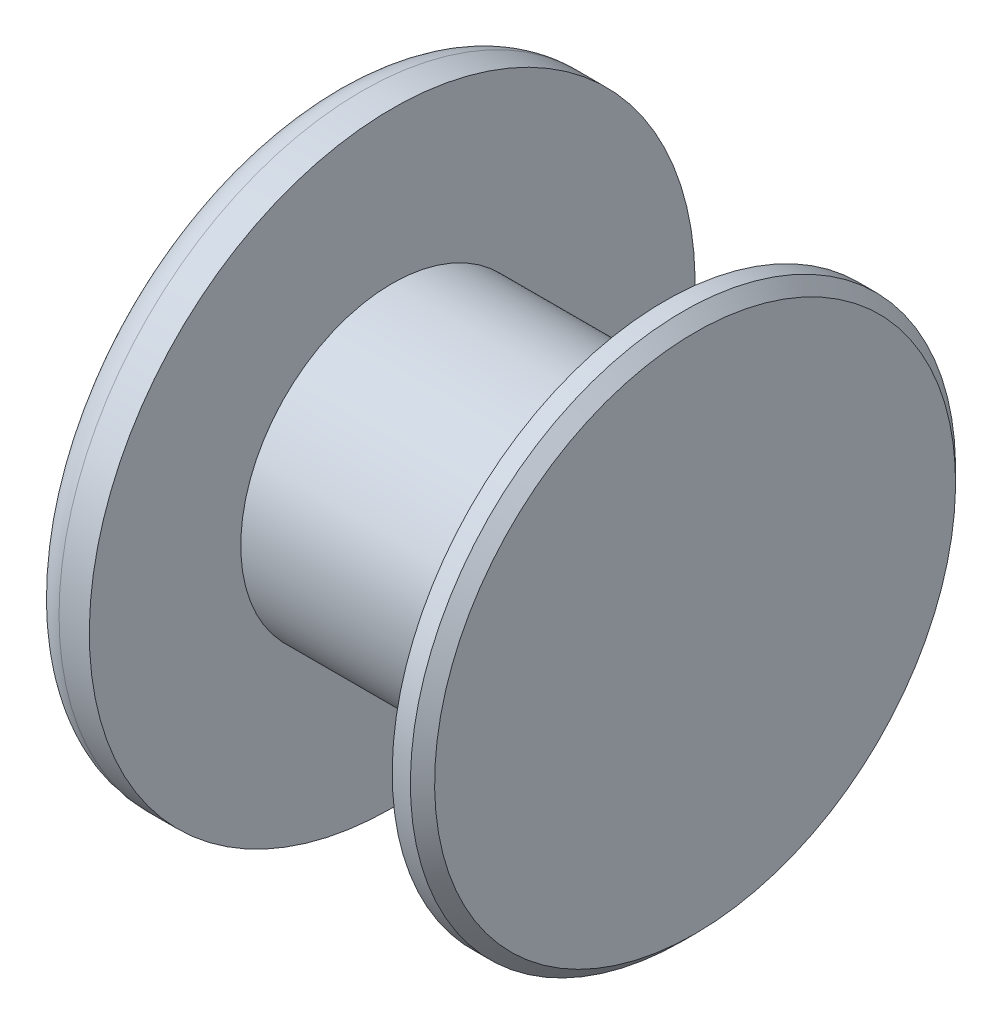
ISO-10303-21;
HEADER;
FILE_DESCRIPTION(('STEP AP214'),'2;1');
FILE_NAME('part.step','',(''),(''),'','','');
FILE_SCHEMA(('AUTOMOTIVE_DESIGN { 1 0 10303 214 1 1 1 1 }'));
ENDSEC;
DATA;
#1=APPLICATION_CONTEXT('core data for automotive mechanical design processes');
#2=APPLICATION_PROTOCOL_DEFINITION('international standard','automotive_design',2000,#1);
#3=PRODUCT_CONTEXT('',#1,'mechanical');
#4=PRODUCT('Part','Part','',(#3));
#5=PRODUCT_RELATED_PRODUCT_CATEGORY('part','',(#4));
#6=PRODUCT_DEFINITION_FORMATION('','',#4);
#7=PRODUCT_DEFINITION_CONTEXT('part definition',#1,'design');
#8=PRODUCT_DEFINITION('design','',#6,#7);
#9=PRODUCT_DEFINITION_SHAPE('','',#8);
#10=(LENGTH_UNIT() NAMED_UNIT(*) SI_UNIT(.MILLI.,.METRE.));
#11=(NAMED_UNIT(*) PLANE_ANGLE_UNIT() SI_UNIT($,.RADIAN.));
#12=(NAMED_UNIT(*) SI_UNIT($,.STERADIAN.) SOLID_ANGLE_UNIT());
#13=UNCERTAINTY_MEASURE_WITH_UNIT(LENGTH_MEASURE(1.E-05),#10,'distance_accuracy_value','');
#14=(GEOMETRIC_REPRESENTATION_CONTEXT(3) GLOBAL_UNCERTAINTY_ASSIGNED_CONTEXT((#13)) GLOBAL_UNIT_ASSIGNED_CONTEXT((#10,
#11,#12)) REPRESENTATION_CONTEXT('',''));
#15=CARTESIAN_POINT('',(0.,0.,0.));
#16=DIRECTION('',(0.,0.,1.));
#17=DIRECTION('',(1.,0.,0.));
#18=AXIS2_PLACEMENT_3D('',#15,#16,#17);
#19=CARTESIAN_POINT('',(3.,4.5,0.));
#20=DIRECTION('',(-1.,0.,0.));
#21=DIRECTION('',(0.,-1.,0.));
#22=AXIS2_PLACEMENT_3D('',#19,#20,#21);
#23=PLANE('',#22);
#24=CARTESIAN_POINT('',(3.,0.,0.));
#25=DIRECTION('',(-1.,0.,0.));
#26=DIRECTION('',(0.,-1.,0.));
#27=AXIS2_PLACEMENT_3D('',#24,#25,#26);
#28=CIRCLE('',#27,4.3);
#29=CARTESIAN_POINT('',(3.,-4.3,0.));
#30=VERTEX_POINT('',#29);
#31=EDGE_CURVE('E10',#30,#30,#28,.F.);
#32=ORIENTED_EDGE('',*,*,#31,.T.);
#33=EDGE_LOOP('',(#32));
#34=FACE_BOUND('',#33,.T.);
#35=ADVANCED_FACE('F41',(#34),#23,.F.);
#36=CARTESIAN_POINT('',(-3.,0.,0.));
#37=DIRECTION('',(1.,0.,0.));
#38=DIRECTION('',(0.,1.,0.));
#39=AXIS2_PLACEMENT_3D('',#36,#37,#38);
#40=PLANE('',#39);
#41=CARTESIAN_POINT('',(-3.,0.,0.));
#42=DIRECTION('',(1.,0.,0.));
#43=DIRECTION('',(0.,1.,0.));
#44=AXIS2_PLACEMENT_3D('',#41,#42,#43);
#45=CIRCLE('',#44,4.5);
#46=CARTESIAN_POINT('',(-3.,4.5,0.));
#47=VERTEX_POINT('',#46);
#48=EDGE_CURVE('E57',#47,#47,#45,.F.);
#49=ORIENTED_EDGE('',*,*,#48,.T.);
#50=EDGE_LOOP('',(#49));
#51=FACE_BOUND('',#50,.T.);
#52=ADVANCED_FACE('F90',(#51),#40,.F.);
#53=CARTESIAN_POINT('',(-3.,0.,0.));
#54=DIRECTION('',(-1.,0.,0.));
#55=DIRECTION('',(0.,-1.,0.));
#56=AXIS2_PLACEMENT_3D('',#53,#54,#55);
#57=CYLINDRICAL_SURFACE('',#56,5.);
#58=CARTESIAN_POINT('',(-2.5,0.,0.));
#59=DIRECTION('',(1.,0.,0.));
#60=DIRECTION('',(0.,1.,0.));
#61=AXIS2_PLACEMENT_3D('',#58,#59,#60);
#62=CIRCLE('',#61,5.);
#63=CARTESIAN_POINT('',(-2.5,5.,0.));
#64=VERTEX_POINT('',#63);
#65=EDGE_CURVE('E53',#64,#64,#62,.T.);
#66=ORIENTED_EDGE('',*,*,#65,.T.);
#67=EDGE_LOOP('',(#66));
#68=FACE_BOUND('',#67,.T.);
#69=CARTESIAN_POINT('',(-2.,0.,0.));
#70=DIRECTION('',(-1.,0.,0.));
#71=DIRECTION('',(0.,-1.,0.));
#72=AXIS2_PLACEMENT_3D('',#69,#70,#71);
#73=CIRCLE('',#72,5.);
#74=CARTESIAN_POINT('',(-2.,-5.,0.));
#75=VERTEX_POINT('',#74);
#76=EDGE_CURVE('E62',#75,#75,#73,.T.);
#77=ORIENTED_EDGE('',*,*,#76,.T.);
#78=EDGE_LOOP('',(#77));
#79=FACE_BOUND('',#78,.T.);
#80=ADVANCED_FACE('F95',(#68,#79),#57,.T.);
#81=CARTESIAN_POINT('',(-2.,5.,0.));
#82=DIRECTION('',(-1.,0.,0.));
#83=DIRECTION('',(0.,-1.,0.));
#84=AXIS2_PLACEMENT_3D('',#81,#82,#83);
#85=PLANE('',#84);
#86=ORIENTED_EDGE('',*,*,#76,.F.);
#87=EDGE_LOOP('',(#86));
#88=FACE_BOUND('',#87,.T.);
#89=CARTESIAN_POINT('',(-2.,0.,0.));
#90=DIRECTION('',(-1.,0.,0.));
#91=DIRECTION('',(0.,-1.,0.));
#92=AXIS2_PLACEMENT_3D('',#89,#90,#91);
#93=CIRCLE('',#92,2.5);
#94=CARTESIAN_POINT('',(-2.,-2.5,0.));
#95=VERTEX_POINT('',#94);
#96=EDGE_CURVE('E65',#95,#95,#93,.T.);
#97=ORIENTED_EDGE('',*,*,#96,.T.);
#98=EDGE_LOOP('',(#97));
#99=FACE_BOUND('',#98,.T.);
#100=ADVANCED_FACE('F101',(#88,#99),#85,.F.);
#101=CARTESIAN_POINT('',(-3.,0.,0.));
#102=DIRECTION('',(-1.,0.,0.));
#103=DIRECTION('',(0.,-1.,0.));
#104=AXIS2_PLACEMENT_3D('',#101,#102,#103);
#105=CYLINDRICAL_SURFACE('',#104,2.5);
#106=ORIENTED_EDGE('',*,*,#96,.F.);
#107=EDGE_LOOP('',(#106));
#108=FACE_BOUND('',#107,.T.);
#109=CARTESIAN_POINT('',(2.5,0.,0.));
#110=DIRECTION('',(-1.,0.,0.));
#111=DIRECTION('',(0.,-1.,0.));
#112=AXIS2_PLACEMENT_3D('',#109,#110,#111);
#113=CIRCLE('',#112,2.5);
#114=CARTESIAN_POINT('',(2.5,-2.5,0.));
#115=VERTEX_POINT('',#114);
#116=EDGE_CURVE('E68',#115,#115,#113,.T.);
#117=ORIENTED_EDGE('',*,*,#116,.T.);
#118=EDGE_LOOP('',(#117));
#119=FACE_BOUND('',#118,.T.);
#120=ADVANCED_FACE('F86',(#108,#119),#105,.T.);
#121=CARTESIAN_POINT('',(2.5,2.5,0.));
#122=DIRECTION('',(1.,0.,0.));
#123=DIRECTION('',(0.,1.,0.));
#124=AXIS2_PLACEMENT_3D('',#121,#122,#123);
#125=PLANE('',#124);
#126=ORIENTED_EDGE('',*,*,#116,.F.);
#127=EDGE_LOOP('',(#126));
#128=FACE_BOUND('',#127,.T.);
#129=CARTESIAN_POINT('',(2.5,0.,0.));
#130=DIRECTION('',(-1.,0.,0.));
#131=DIRECTION('',(0.,-1.,0.));
#132=AXIS2_PLACEMENT_3D('',#129,#130,#131);
#133=CIRCLE('',#132,4.5);
#134=CARTESIAN_POINT('',(2.5,-4.5,0.));
#135=VERTEX_POINT('',#134);
#136=EDGE_CURVE('E71',#135,#135,#133,.T.);
#137=ORIENTED_EDGE('',*,*,#136,.T.);
#138=EDGE_LOOP('',(#137));
#139=FACE_BOUND('',#138,.T.);
#140=ADVANCED_FACE('F75',(#128,#139),#125,.F.);
#141=CARTESIAN_POINT('',(-3.,0.,0.));
#142=DIRECTION('',(-1.,0.,0.));
#143=DIRECTION('',(0.,-1.,0.));
#144=AXIS2_PLACEMENT_3D('',#141,#142,#143);
#145=CYLINDRICAL_SURFACE('',#144,4.5);
#146=CARTESIAN_POINT('',(2.8,0.,0.));
#147=DIRECTION('',(-1.,0.,0.));
#148=DIRECTION('',(0.,-1.,0.));
#149=AXIS2_PLACEMENT_3D('',#146,#147,#148);
#150=CIRCLE('',#149,4.5);
#151=CARTESIAN_POINT('',(2.8,-4.5,0.));
#152=VERTEX_POINT('',#151);
#153=EDGE_CURVE('E49',#152,#152,#150,.T.);
#154=ORIENTED_EDGE('',*,*,#153,.T.);
#155=EDGE_LOOP('',(#154));
#156=FACE_BOUND('',#155,.T.);
#157=ORIENTED_EDGE('',*,*,#136,.F.);
#158=EDGE_LOOP('',(#157));
#159=FACE_BOUND('',#158,.T.);
#160=ADVANCED_FACE('F77',(#156,#159),#145,.T.);
#161=CARTESIAN_POINT('',(-2.5,0.,0.));
#162=DIRECTION('',(1.,0.,0.));
#163=DIRECTION('',(0.,1.,0.));
#164=AXIS2_PLACEMENT_3D('',#161,#162,#163);
#165=TOROIDAL_SURFACE('',#164,4.5,0.5);
#166=ORIENTED_EDGE('',*,*,#65,.F.);
#167=EDGE_LOOP('',(#166));
#168=FACE_BOUND('',#167,.T.);
#169=ORIENTED_EDGE('',*,*,#48,.F.);
#170=EDGE_LOOP('',(#169));
#171=FACE_BOUND('',#170,.T.);
#172=ADVANCED_FACE('F79',(#168,#171),#165,.T.);
#173=CARTESIAN_POINT('',(2.8,0.,0.));
#174=DIRECTION('',(-1.,0.,0.));
#175=DIRECTION('',(0.,-1.,0.));
#176=AXIS2_PLACEMENT_3D('',#173,#174,#175);
#177=CONICAL_SURFACE('',#176,4.5,0.785398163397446);
#178=ORIENTED_EDGE('',*,*,#31,.F.);
#179=EDGE_LOOP('',(#178));
#180=FACE_BOUND('',#179,.T.);
#181=ORIENTED_EDGE('',*,*,#153,.F.);
#182=EDGE_LOOP('',(#181));
#183=FACE_BOUND('',#182,.T.);
#184=ADVANCED_FACE('F44',(#180,#183),#177,.T.);
#185=CLOSED_SHELL('',(#35,#52,#80,#100,#120,#140,#160,#172,#184));
#186=MANIFOLD_SOLID_BREP('B2',#185);
#187=ADVANCED_BREP_SHAPE_REPRESENTATION('',(#18,#186),#14);
#188=SHAPE_DEFINITION_REPRESENTATION(#9,#187);
ENDSEC;
END-ISO-10303-21;
